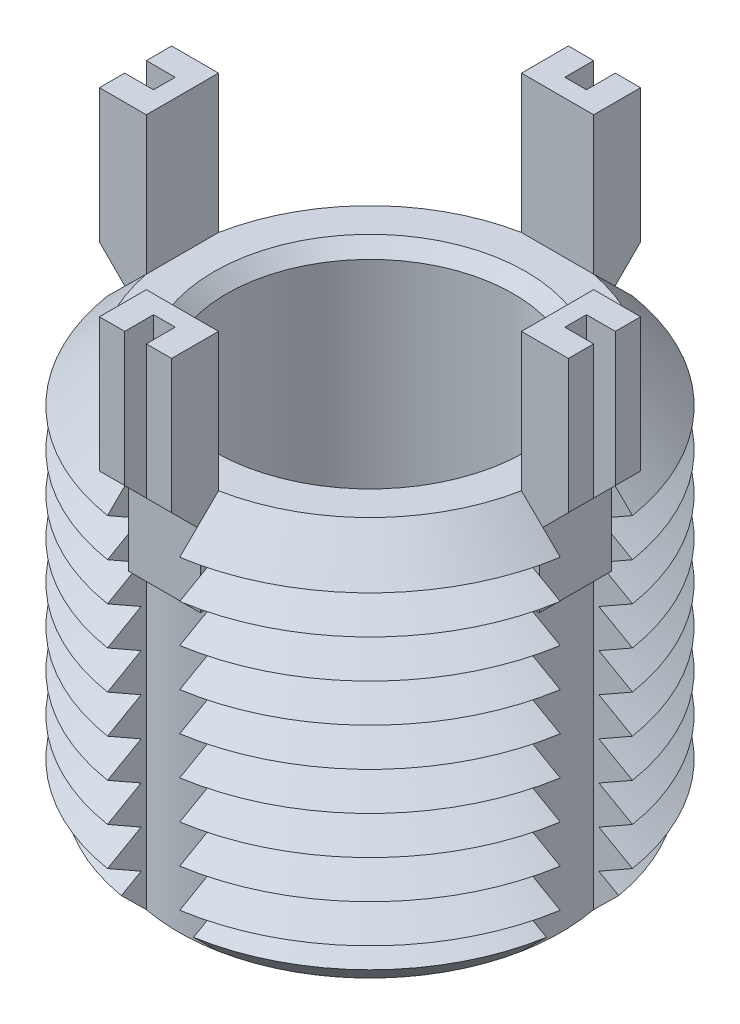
from build123d import *

# Parameters (mm, degrees)
SKETCH1_R               = 12.7
BOSS_EXTRUDE1_DEPTH     = 22.098
CHAMFER1_SIZE           = 2.117
LPATTERN1_COUNT         = 9
LPATTERN1_PITCH         = 2.117
CUT_EXTRUDE1_REACH      = 30.476
CIRPATTERN1_COUNT       = 4
BOSS_EXTRUDE3_DEPTH     = 2
CIRPATTERN2_COUNT       = 4
CUT_EXTRUDE3_DEPTH      = 35.96403449
CUT_EXTRUDE3_DEPTH_BACK = 35.96403449
SKETCH6_W               = 1.6
SKETCH6_H               = 1.2
SKETCH6_W_2             = 1.2
SKETCH6_H_2             = 1.6
SKETCH7_R               = 7.9375
CUT_EXTRUDE4_DEPTH      = 22.098
CHAMFER2_SIZE           = 0.7055


with BuildPart() as part:
    # Sketch1 → Boss-Extrude1 (new body)
    with BuildSketch(Plane(origin=(0, 0, 0), x_dir=(1, 0, 0), z_dir=(0, 1, 0))):
        with Locations(Location((0, 0, 0), (0, 0, 270))):
            Circle(SKETCH1_R)
    extrude(amount=-BOSS_EXTRUDE1_DEPTH)

    # Chamfer1
    chamfer1_edges = [part.edges().sort_by_distance(p)[0] for p in [
        (0, 0, -12.7),
        (0, -22.098, -12.7),
    ]]
    chamfer(chamfer1_edges, length=CHAMFER1_SIZE)

    # Sketch3 → Cut-Revolve1 (revolve, cut)
    with BuildSketch(Plane(origin=(0, 0, 0), x_dir=(0, 0, -1), z_dir=(1, 0, 0))):
        Polygon((-12.7, -2.117), (-10.86662422, -3.1755), (-12.7, -4.234), align=None)
    cut_revolve1 = revolve(axis=Axis((0, 0.885892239, 0), (0, -1, 0)), mode=Mode.SUBTRACT)

    # LPattern1: Cut-Revolve1 ×9
    with Locations(*[(0, -i * LPATTERN1_PITCH, 0) for i in range(1, LPATTERN1_COUNT)]):
        add(cut_revolve1, mode=Mode.SUBTRACT)

    # Cut-Extrude1: up to this cone (the profile starts inside it)
    cut_extrude1_end = Plane(origin=(0, 0, 0), z_dir=(0, 1, 0)).offset(-32.680999) * Cone(1e-06, 96.338, 96.337999, align=(Align.CENTER, Align.CENTER, Align.MIN), mode=Mode.PRIVATE)
    # Sketch4 → Cut-Extrude1 (cut, up to the surface)
    with BuildSketch(Plane(origin=(0, 0, 0), x_dir=(1, 0, 0), z_dir=(0, 1, 0)), mode=Mode.PRIVATE) as cut_extrude1_sk1:
        with BuildLine():
            Line((-10.392299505, 2), (-12.541531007, 2))
            ThreePointArc((-12.541531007, 2), (-12.7, 0), (-12.541531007, -2))
            Line((-12.541531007, -2), (-10.392299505, -2))
            ThreePointArc((-10.392299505, -2), (-10.583, 0), (-10.392299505, 2))
        make_face()
    cut_extrude1_tool1 = extrude(cut_extrude1_sk1.sketch, amount=-CUT_EXTRUDE1_REACH, mode=Mode.PRIVATE) & cut_extrude1_end
    cut_extrude1 = cut_extrude1_tool1.solids().sort_by_distance((-11.583253, 0, 0))[0]
    add(cut_extrude1, mode=Mode.SUBTRACT)

    # CirPattern1: Cut-Extrude1 ×4 about axis
    cirpattern1_axis = Axis((0, 0, 0), (0, 1, 0))
    for i in range(1, CIRPATTERN1_COUNT):
        add(cut_extrude1.rotate(cirpattern1_axis, i * 360 / CIRPATTERN1_COUNT), mode=Mode.SUBTRACT)

    # Sketch5 → Boss-Extrude3 (add, symmetric)
    with BuildSketch(Plane(origin=(0, 0, 0), x_dir=(0, 0, -1), z_dir=(1, 0, 0))):
        Polygon((-10.392299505, 7.649), (-10.392299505, -5.351), (-11.392299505, -5.351), (-11.392299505, -1.351), (-12.992299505, 0.249), (-12.992299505, 7.649), align=None)
    boss_extrude3 = extrude(amount=BOSS_EXTRUDE3_DEPTH, both=True)

    # CirPattern2: Boss-Extrude3 ×4 about axis
    cirpattern2_axis = Axis((0, 0, 0), (0, 1, 0))
    for i in range(1, CIRPATTERN2_COUNT):
        add(boss_extrude3.rotate(cirpattern2_axis, i * 360 / CIRPATTERN2_COUNT))

    # Sketch6 → Cut-Extrude3 (cut, two sides: drawn at the far end of the back side and taken through both)
    with BuildSketch(Plane(origin=(0, 7.649, 0), x_dir=(1, 0, 0), z_dir=(0, 1, 0)).offset(-CUT_EXTRUDE3_DEPTH_BACK)):
        with Locations((-12.192299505, 0)):
            Rectangle(SKETCH6_W, SKETCH6_H)
        with Locations((0, 12.192299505)):
            Rectangle(SKETCH6_W_2, SKETCH6_H_2)
        with Locations((12.192299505, 0)):
            Rectangle(SKETCH6_W, SKETCH6_H)
        with Locations((0, -12.192299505)):
            Rectangle(SKETCH6_W_2, SKETCH6_H_2)
    extrude(amount=CUT_EXTRUDE3_DEPTH + CUT_EXTRUDE3_DEPTH_BACK, mode=Mode.SUBTRACT)

    # Sketch7 → Cut-Extrude4 (cut)
    with BuildSketch(Plane(origin=(0, 0, 0), x_dir=(1, 0, 0), z_dir=(0, 1, 0))):
        with Locations(Location((0, 0, 0), (0, 0, 270))):
            Circle(SKETCH7_R)
    extrude(amount=-CUT_EXTRUDE4_DEPTH, mode=Mode.SUBTRACT)

    # Chamfer2
    chamfer2_edges = [part.edges().sort_by_distance(p)[0] for p in [
        (0, 0, -7.9375),
        (0, -22.098, -7.9375),
    ]]
    chamfer(chamfer2_edges, length=CHAMFER2_SIZE)


solid = part.part
